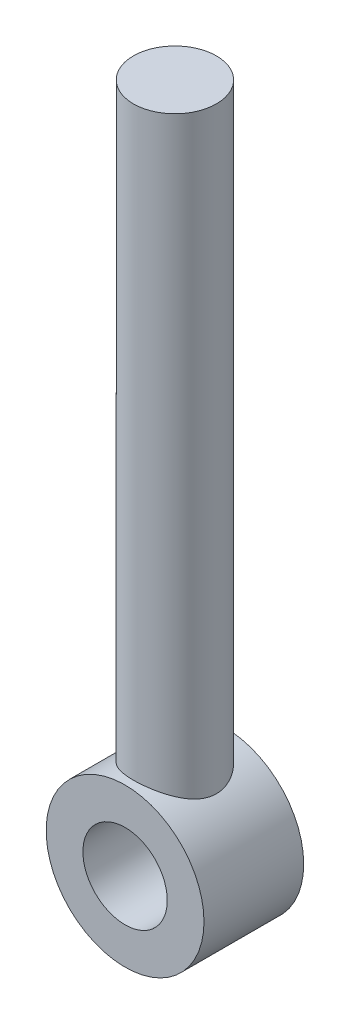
from build123d import *

# Parameters (mm, degrees)
SKETCH1_R           = 7.9375
EXTRUDE1_DEPTH      = 114.3
EXTRUDE2_DEPTH      = 9.525
EXTRUDE2_DEPTH_BACK = 9.525
SKETCH2_R           = 15.08125
SKETCH2_R_2         = 8.060014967


with BuildPart() as part:
    # Sketch1 → Extrude1 (new body)
    with BuildSketch(Plane(origin=(0, 0, 0), x_dir=(1, 0, 0), z_dir=(0, 1, 0))):
        with Locations(Location((0, 0, 0), (0, 0, 270))):
            Circle(SKETCH1_R)
    extrude(amount=EXTRUDE1_DEPTH)

    # Sketch2 → Extrude2 (add, two sides: drawn at the far end of the back side and taken through both)
    with BuildSketch(Plane.XY.offset(-EXTRUDE2_DEPTH_BACK)):
        with Locations((0, -12.7)):
            Circle(SKETCH2_R)
        with Locations((0, -12.7)):
            Circle(SKETCH2_R_2, mode=Mode.SUBTRACT)
    extrude(amount=EXTRUDE2_DEPTH + EXTRUDE2_DEPTH_BACK)


solid = part.part
